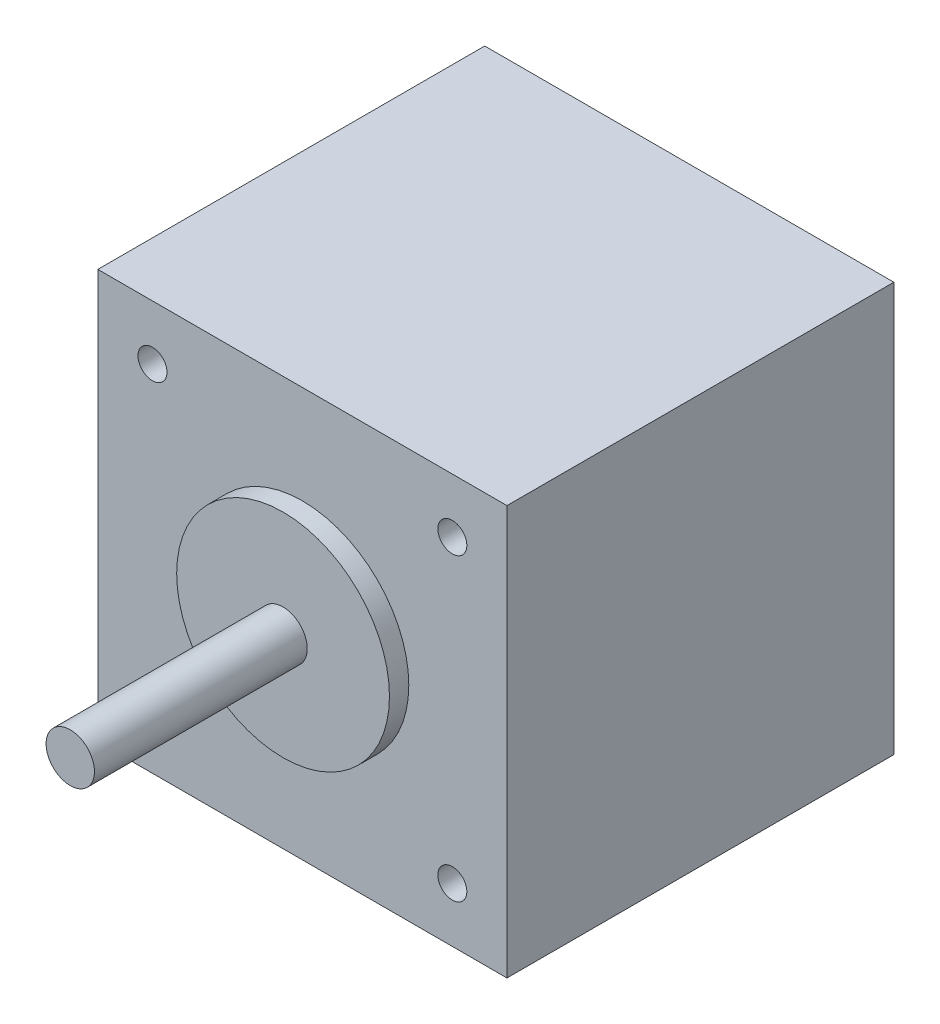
from build123d import *

# Parameters (mm, degrees)
SKIZZE1_W                       = 42.3
SKIZZE1_H                       = 42.3
AUFSATZ_LINEAR_AUSTRAGEN1_DEPTH = 40
SKIZZE2_R                       = 11
AUFSATZ_LINEAR_AUSTRAGEN2_DEPTH = 2
SKIZZE5_R                       = 2.5
AUFSATZ_LINEAR_AUSTRAGEN3_DEPTH = 22
SKIZZE6_R                       = 1.5
SCHNITT_LINEAR_AUSTRAGEN1_DEPTH = 4.5


with BuildPart() as part:
    # Skizze1 → Aufsatz-Linear austragen1 (new body)
    with BuildSketch(Plane.XY):
        with Locations((21.15, 21.15)):
            Rectangle(SKIZZE1_W, SKIZZE1_H)
    extrude(amount=AUFSATZ_LINEAR_AUSTRAGEN1_DEPTH)

    # Skizze2 → Aufsatz-Linear austragen2 (add)
    with BuildSketch(Plane.XY.offset(40)):
        with Locations(Location((21.15, 21.15, 0), (0, 0, 180))):
            Circle(SKIZZE2_R)
    extrude(amount=AUFSATZ_LINEAR_AUSTRAGEN2_DEPTH)

    # Skizze5 → Aufsatz-Linear austragen3 (add)
    with BuildSketch(Plane.XY.offset(42)):
        with Locations((21.15, 21.15)):
            Circle(SKIZZE5_R)
    extrude(amount=AUFSATZ_LINEAR_AUSTRAGEN3_DEPTH)

    # Skizze6 → Schnitt-Linear austragen1 (cut)
    with BuildSketch(Plane.XY.offset(40)):
        with Locations((5.65, 36.65)):
            Circle(SKIZZE6_R)
        with Locations((36.65, 36.65)):
            Circle(SKIZZE6_R)
        with Locations((36.65, 5.65)):
            Circle(SKIZZE6_R)
        with Locations((5.65, 5.65)):
            Circle(SKIZZE6_R)
    extrude(amount=-SCHNITT_LINEAR_AUSTRAGEN1_DEPTH, mode=Mode.SUBTRACT)


solid = part.part
